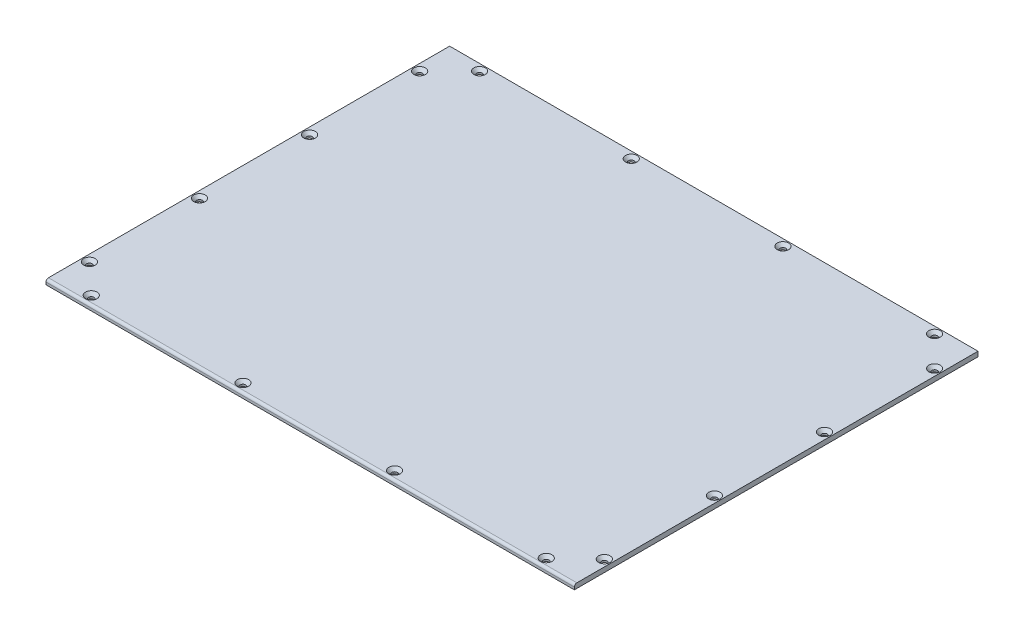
from build123d import *

# Parameters (mm, degrees)
SKETCH_2_W                 = 432
SKETCH_2_H                 = 330
EXTRUDE_1_DEPTH            = 4
FILLET_1_R                 = 2
HOLE_WIZARD_M4_AT_2_COUNT  = 2
HOLE_WIZARD_M4_AT_2_PITCH  = 124
HOLE_WIZARD_M4_AT_3_COUNT  = 2
HOLE_WIZARD_M4_AT_3_PITCH  = 248
HOLE_WIZARD_M4_AT_4_COUNT  = 2
HOLE_WIZARD_M4_AT_4_PITCH  = 372
HOLE_WIZARD_M4_AT_5_COUNT  = 2
HOLE_WIZARD_M4_AT_5_PITCH  = 397.256214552
HOLE_WIZARD_M4_AT_6_COUNT  = 2
HOLE_WIZARD_M4_AT_6_PITCH  = 412.701465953
HOLE_WIZARD_M4_AT_7_COUNT  = 2
HOLE_WIZARD_M4_AT_7_PITCH  = 446.130586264
HOLE_WIZARD_M4_AT_8_COUNT  = 2
HOLE_WIZARD_M4_AT_8_PITCH  = 493.905355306
HOLE_WIZARD_M4_AT_9_COUNT  = 2
HOLE_WIZARD_M4_AT_9_PITCH  = 489.070802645
HOLE_WIZARD_M4_AT_10_COUNT = 2
HOLE_WIZARD_M4_AT_10_PITCH = 402.87746276
HOLE_WIZARD_M4_AT_11_COUNT = 2
HOLE_WIZARD_M4_AT_11_PITCH = 340.855174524
HOLE_WIZARD_M4_AT_12_COUNT = 2
HOLE_WIZARD_M4_AT_12_PITCH = 317.5
HOLE_WIZARD_M4_AT_13_COUNT = 2
HOLE_WIZARD_M4_AT_13_PITCH = 295.517342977
HOLE_WIZARD_M4_AT_14_COUNT = 2
HOLE_WIZARD_M4_AT_14_PITCH = 205.962375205
HOLE_WIZARD_M4_AT_15_COUNT = 2
HOLE_WIZARD_M4_AT_15_PITCH = 117.091844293
HOLE_WIZARD_M4_AT_16_COUNT = 2
HOLE_WIZARD_M4_AT_16_PITCH = 34.648232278


with BuildPart() as part:
    # Sketch 2 → Extrude 1 (new body)
    with BuildSketch(Plane(origin=(0, 0, 0), x_dir=(1, 0, 0), z_dir=(0, 1, 0))):
        with Locations((216, 165)):
            Rectangle(SKETCH_2_W, SKETCH_2_H)
    extrude(amount=EXTRUDE_1_DEPTH)

    # Fillet 1
    fillet_1_edges = [part.edges().sort_by_distance(p)[0] for p in [
        (216, 4, 0),
    ]]
    fillet(fillet_1_edges, radius=FILLET_1_R)

    # Sketch 4 → Hole Wizard M4 (revolve, cut)
    with BuildSketch(Plane(origin=(30, 4, -324.5), x_dir=(0, 0, 1), z_dir=(1, 0, 0))):
        Polygon((0, 0), (0, 4), (2.25, 4), (2.25, 2.45), (4.7, 0), align=None)
    hole_wizard_m4 = revolve(axis=Axis((30, 10.35, -324.5), (0, -1, 0)), mode=Mode.SUBTRACT)

    # Hole Wizard M4 at 2: Hole Wizard M4 ×2
    with Locations(*[(i * HOLE_WIZARD_M4_AT_2_PITCH, 0, 0) for i in range(1, HOLE_WIZARD_M4_AT_2_COUNT)]):
        add(hole_wizard_m4, mode=Mode.SUBTRACT)

    # Hole Wizard M4 at 3: Hole Wizard M4 ×2
    with Locations(*[(i * HOLE_WIZARD_M4_AT_3_PITCH, 0, 0) for i in range(1, HOLE_WIZARD_M4_AT_3_COUNT)]):
        add(hole_wizard_m4, mode=Mode.SUBTRACT)

    # Hole Wizard M4 at 4: Hole Wizard M4 ×2
    with Locations(*[(i * HOLE_WIZARD_M4_AT_4_PITCH, 0, 0) for i in range(1, HOLE_WIZARD_M4_AT_4_COUNT)]):
        add(hole_wizard_m4, mode=Mode.SUBTRACT)

    # Hole Wizard M4 at 5: Hole Wizard M4 ×2
    with Locations(*[Vector(0.9980964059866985, 0, 0.06167304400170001) * (i * HOLE_WIZARD_M4_AT_5_PITCH) for i in range(1, HOLE_WIZARD_M4_AT_5_COUNT)]):
        add(hole_wizard_m4, mode=Mode.SUBTRACT)

    # Hole Wizard M4 at 6: Hole Wizard M4 ×2
    with Locations(*[Vector(0.9607428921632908, 0, 0.2774402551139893) * (i * HOLE_WIZARD_M4_AT_6_PITCH) for i in range(1, HOLE_WIZARD_M4_AT_6_COUNT)]):
        add(hole_wizard_m4, mode=Mode.SUBTRACT)

    # Hole Wizard M4 at 7: Hole Wizard M4 ×2
    with Locations(*[Vector(0.8887532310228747, 0, 0.4583859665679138) * (i * HOLE_WIZARD_M4_AT_7_PITCH) for i in range(1, HOLE_WIZARD_M4_AT_7_COUNT)]):
        add(hole_wizard_m4, mode=Mode.SUBTRACT)

    # Hole Wizard M4 at 8: Hole Wizard M4 ×2
    with Locations(*[Vector(0.8027853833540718, 0, 0.5962680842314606) * (i * HOLE_WIZARD_M4_AT_8_PITCH) for i in range(1, HOLE_WIZARD_M4_AT_8_COUNT)]):
        add(hole_wizard_m4, mode=Mode.SUBTRACT)

    # Hole Wizard M4 at 9: Hole Wizard M4 ×2
    with Locations(*[Vector(0.760626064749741, 0, 0.649190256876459) * (i * HOLE_WIZARD_M4_AT_9_PITCH) for i in range(1, HOLE_WIZARD_M4_AT_9_COUNT)]):
        add(hole_wizard_m4, mode=Mode.SUBTRACT)

    # Hole Wizard M4 at 10: Hole Wizard M4 ×2
    with Locations(*[Vector(0.6155717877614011, 0, 0.7880808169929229) * (i * HOLE_WIZARD_M4_AT_10_PITCH) for i in range(1, HOLE_WIZARD_M4_AT_10_COUNT)]):
        add(hole_wizard_m4, mode=Mode.SUBTRACT)

    # Hole Wizard M4 at 11: Hole Wizard M4 ×2
    with Locations(*[Vector(0.3637908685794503, 0, 0.9314806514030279) * (i * HOLE_WIZARD_M4_AT_11_PITCH) for i in range(1, HOLE_WIZARD_M4_AT_11_COUNT)]):
        add(hole_wizard_m4, mode=Mode.SUBTRACT)

    # Hole Wizard M4 at 12: Hole Wizard M4 ×2
    with Locations(*[(0, 0, i * HOLE_WIZARD_M4_AT_12_PITCH) for i in range(1, HOLE_WIZARD_M4_AT_12_COUNT)]):
        add(hole_wizard_m4, mode=Mode.SUBTRACT)

    # Hole Wizard M4 at 13: Hole Wizard M4 ×2
    with Locations(*[Vector(-0.08290545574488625, 0, 0.9965574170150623) * (i * HOLE_WIZARD_M4_AT_13_PITCH) for i in range(1, HOLE_WIZARD_M4_AT_13_COUNT)]):
        add(hole_wizard_m4, mode=Mode.SUBTRACT)

    # Hole Wizard M4 at 14: Hole Wizard M4 ×2
    with Locations(*[Vector(-0.11895376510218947, 0, 0.9928997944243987) * (i * HOLE_WIZARD_M4_AT_14_PITCH) for i in range(1, HOLE_WIZARD_M4_AT_14_COUNT)]):
        add(hole_wizard_m4, mode=Mode.SUBTRACT)

    # Hole Wizard M4 at 15: Hole Wizard M4 ×2
    with Locations(*[Vector(-0.2092374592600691, 0, 0.9778648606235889) * (i * HOLE_WIZARD_M4_AT_15_PITCH) for i in range(1, HOLE_WIZARD_M4_AT_15_COUNT)]):
        add(hole_wizard_m4, mode=Mode.SUBTRACT)

    # Hole Wizard M4 at 16: Hole Wizard M4 ×2
    with Locations(*[Vector(-0.7071067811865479, 0, 0.7071067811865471) * (i * HOLE_WIZARD_M4_AT_16_PITCH) for i in range(1, HOLE_WIZARD_M4_AT_16_COUNT)]):
        add(hole_wizard_m4, mode=Mode.SUBTRACT)


solid = part.part
